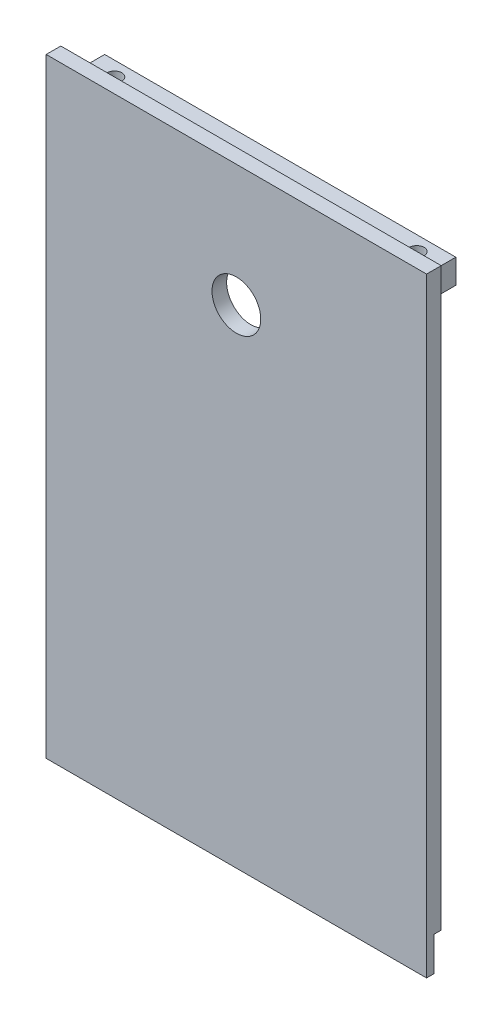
from build123d import *

# Parameters (mm, degrees)
SKETCH1_W           = 78
SKETCH1_H           = 249
BOSS_EXTRUDE1_DEPTH = 3
BOSS_EXTRUDE2_DEPTH = 78
SKETCH5_W           = 3
SKETCH5_H           = 6
CUT_EXTRUDE1_DEPTH  = 250.144536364
SKETCH6_R           = 1.5
CUT_EXTRUDE2_DEPTH  = 250.144536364
SKETCH7_R           = 5
CUT_EXTRUDE3_DEPTH  = 131.775571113
CUT_EXTRUDE4_DEPTH  = 148.038260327


with BuildPart() as part:
    # Sketch1 → Boss-Extrude1 (new body)
    with BuildSketch(Plane.XY):
        Rectangle(SKETCH1_W, SKETCH1_H)
    extrude(amount=BOSS_EXTRUDE1_DEPTH)

    # Sketch3 → Boss-Extrude2 (add, through all)
    with BuildSketch(Plane.ZY.offset(39)):
        Polygon((3, -124.5), (0, -124.5), (0, -121.5), (-6, -121.5), (-6, -116.5), (0, -116.5), (0, 116.5), (-6, 116.5), (-6, 121.5), (0, 121.5), (0, 124.5), (3, 124.5), align=None)
    extrude(amount=-BOSS_EXTRUDE2_DEPTH)

    # Sketch5 → Cut-Extrude1 (cut, through all)
    with BuildSketch(Plane(origin=(0, -121.5, 0), x_dir=(-1, 0, 0), z_dir=(0, -1, 0))):
        with Locations((37.5, 3)):
            Rectangle(SKETCH5_W, SKETCH5_H)
        with Locations((-37.5, 3)):
            Rectangle(SKETCH5_W, SKETCH5_H)
    extrude(amount=-CUT_EXTRUDE1_DEPTH, mode=Mode.SUBTRACT)

    # Sketch6 → Cut-Extrude2 (cut, through all)
    with BuildSketch(Plane.XZ.offset(121.5)):
        with Locations((-31, -3)):
            Circle(SKETCH6_R)
        with Locations((31, -3)):
            Circle(SKETCH6_R)
    extrude(amount=-CUT_EXTRUDE2_DEPTH, mode=Mode.SUBTRACT)

    # Sketch7 → Cut-Extrude3 (cut, through all)
    with BuildSketch(Plane.XY.offset(3)):
        with Locations((0, 99.5)):
            Circle(SKETCH7_R)
    extrude(amount=-CUT_EXTRUDE3_DEPTH, mode=Mode.SUBTRACT)

    # Sketch8 → Cut-Extrude4 (cut, through all)
    with BuildSketch(Plane.ZY.offset(39)):
        Polygon((3, -124.5), (0, -124.5), (0, -121.5), (-6, -121.5), (-6, -116.5), (0, -116.5), (0, 6.5), (1.5, 6.5), (1.5, -0.5), (3, -0.5), align=None)
    extrude(amount=-CUT_EXTRUDE4_DEPTH, mode=Mode.SUBTRACT)


solid = part.part
